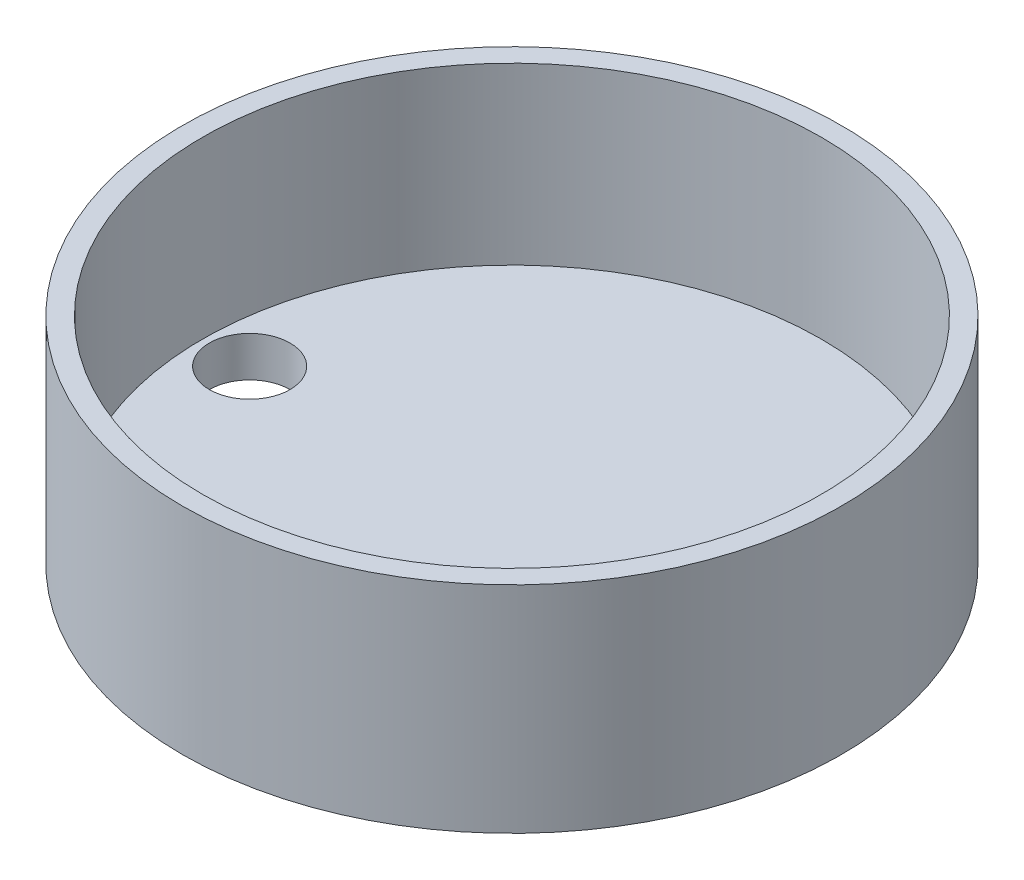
from build123d import *

# Parameters (mm, degrees)
SKETCH1_R           = 77.7875
BOSS_EXTRUDE1_DEPTH = 50.8
SKETCH2_R           = 73.025
CUT_EXTRUDE1_DEPTH  = 41.275
SKETCH3_R           = 9.525
CUT_EXTRUDE2_DEPTH  = 122.171078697


with BuildPart() as part:
    # Sketch1 → Boss-Extrude1 (new body)
    with BuildSketch(Plane(origin=(0, 0, 0), x_dir=(1, 0, 0), z_dir=(0, 1, 0))):
        with Locations(Location((0, 0, 0), (0, 0, 270))):
            Circle(SKETCH1_R)
    extrude(amount=-BOSS_EXTRUDE1_DEPTH)

    # Sketch2 → Cut-Extrude1 (cut)
    with BuildSketch(Plane(origin=(0, 0, 0), x_dir=(1, 0, 0), z_dir=(0, 1, 0))):
        with Locations(Location((0, 0, 0), (0, 0, 270))):
            Circle(SKETCH2_R)
    extrude(amount=-CUT_EXTRUDE1_DEPTH, mode=Mode.SUBTRACT)

    # Sketch3 → Cut-Extrude2 (cut, through all)
    with BuildSketch(Plane.XZ.offset(50.8)):
        with Locations(Location((61.8998, 0, 0), (0, 0, 270))):
            Circle(SKETCH3_R)
        with Locations(Location((-61.8998, 0, 0), (0, 0, 270))):
            Circle(SKETCH3_R)
    extrude(amount=-CUT_EXTRUDE2_DEPTH, mode=Mode.SUBTRACT)


solid = part.part
